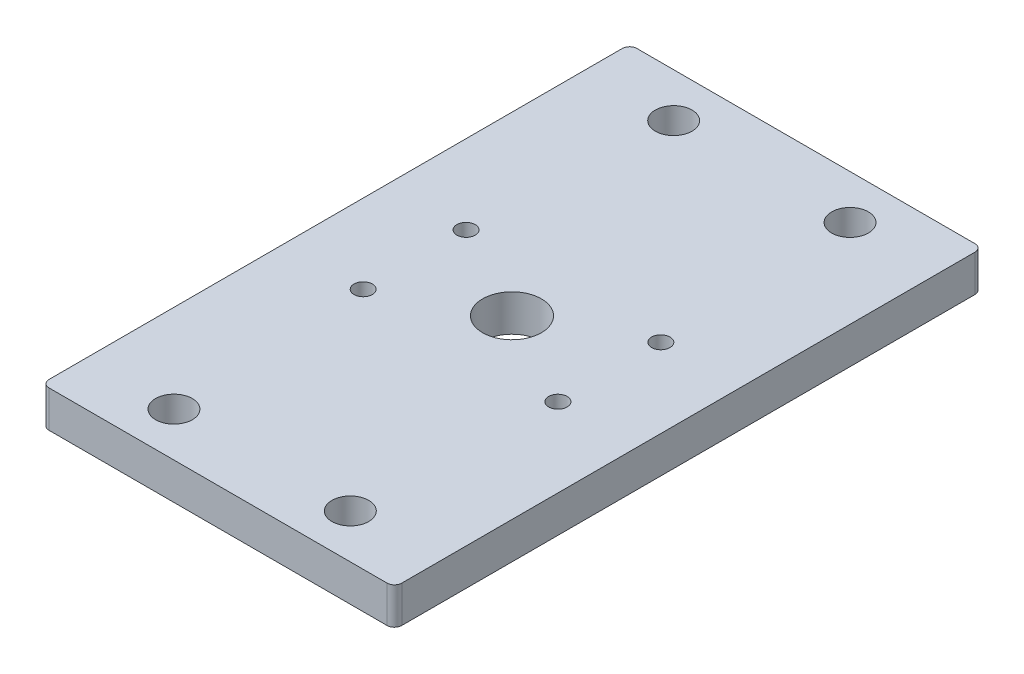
ISO-10303-21;
HEADER;
FILE_DESCRIPTION(('STEP AP214'),'2;1');
FILE_NAME('part.step','',(''),(''),'','','');
FILE_SCHEMA(('AUTOMOTIVE_DESIGN { 1 0 10303 214 1 1 1 1 }'));
ENDSEC;
DATA;
#1=APPLICATION_CONTEXT('core data for automotive mechanical design processes');
#2=APPLICATION_PROTOCOL_DEFINITION('international standard','automotive_design',2000,#1);
#3=PRODUCT_CONTEXT('',#1,'mechanical');
#4=PRODUCT('Part','Part','',(#3));
#5=PRODUCT_RELATED_PRODUCT_CATEGORY('part','',(#4));
#6=PRODUCT_DEFINITION_FORMATION('','',#4);
#7=PRODUCT_DEFINITION_CONTEXT('part definition',#1,'design');
#8=PRODUCT_DEFINITION('design','',#6,#7);
#9=PRODUCT_DEFINITION_SHAPE('','',#8);
#10=(LENGTH_UNIT() NAMED_UNIT(*) SI_UNIT(.MILLI.,.METRE.));
#11=(NAMED_UNIT(*) PLANE_ANGLE_UNIT() SI_UNIT($,.RADIAN.));
#12=(NAMED_UNIT(*) SI_UNIT($,.STERADIAN.) SOLID_ANGLE_UNIT());
#13=UNCERTAINTY_MEASURE_WITH_UNIT(LENGTH_MEASURE(1.E-05),#10,'distance_accuracy_value','');
#14=(GEOMETRIC_REPRESENTATION_CONTEXT(3) GLOBAL_UNCERTAINTY_ASSIGNED_CONTEXT((#13)) GLOBAL_UNIT_ASSIGNED_CONTEXT((#10,
#11,#12)) REPRESENTATION_CONTEXT('',''));
#15=CARTESIAN_POINT('',(0.,0.,0.));
#16=DIRECTION('',(0.,0.,1.));
#17=DIRECTION('',(1.,0.,0.));
#18=AXIS2_PLACEMENT_3D('',#15,#16,#17);
#19=CARTESIAN_POINT('',(152.4,31.75,0.));
#20=DIRECTION('',(1.,0.,0.));
#21=DIRECTION('',(0.,0.,-1.));
#22=AXIS2_PLACEMENT_3D('',#19,#20,#21);
#23=PLANE('',#22);
#24=DIRECTION('',(0.,0.,1.));
#25=VECTOR('',#24,1.);
#26=CARTESIAN_POINT('',(152.4,0.,0.));
#27=LINE('',#26,#25);
#28=CARTESIAN_POINT('',(152.4,0.,6.35000000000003));
#29=VERTEX_POINT('',#28);
#30=CARTESIAN_POINT('',(152.4,0.,501.65));
#31=VERTEX_POINT('',#30);
#32=EDGE_CURVE('E125',#29,#31,#27,.T.);
#33=ORIENTED_EDGE('',*,*,#32,.F.);
#34=DIRECTION('',(0.,-1.,0.));
#35=VECTOR('',#34,1.);
#36=CARTESIAN_POINT('',(152.4,31.75,6.35000000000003));
#37=LINE('',#36,#35);
#38=CARTESIAN_POINT('',(152.4,31.75,6.35000000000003));
#39=VERTEX_POINT('',#38);
#40=EDGE_CURVE('E11',#29,#39,#37,.F.);
#41=ORIENTED_EDGE('',*,*,#40,.T.);
#42=DIRECTION('',(0.,0.,1.));
#43=VECTOR('',#42,1.);
#44=CARTESIAN_POINT('',(152.4,31.75,0.));
#45=LINE('',#44,#43);
#46=CARTESIAN_POINT('',(152.4,31.75,501.65));
#47=VERTEX_POINT('',#46);
#48=EDGE_CURVE('E134',#39,#47,#45,.T.);
#49=ORIENTED_EDGE('',*,*,#48,.T.);
#50=DIRECTION('',(0.,-1.,0.));
#51=VECTOR('',#50,1.);
#52=CARTESIAN_POINT('',(152.4,0.,501.65));
#53=LINE('',#52,#51);
#54=EDGE_CURVE('E40',#47,#31,#53,.T.);
#55=ORIENTED_EDGE('',*,*,#54,.T.);
#56=EDGE_LOOP('',(#33,#41,#49,#55));
#57=FACE_BOUND('',#56,.T.);
#58=ADVANCED_FACE('F32',(#57),#23,.T.);
#59=CARTESIAN_POINT('',(152.4,31.75,0.));
#60=DIRECTION('',(0.,0.,1.));
#61=DIRECTION('',(1.,0.,0.));
#62=AXIS2_PLACEMENT_3D('',#59,#60,#61);
#63=PLANE('',#62);
#64=DIRECTION('',(-1.,0.,0.));
#65=VECTOR('',#64,1.);
#66=CARTESIAN_POINT('',(152.4,0.,0.));
#67=LINE('',#66,#65);
#68=CARTESIAN_POINT('',(146.05,0.,0.));
#69=VERTEX_POINT('',#68);
#70=CARTESIAN_POINT('',(-146.05,0.,0.));
#71=VERTEX_POINT('',#70);
#72=EDGE_CURVE('E127',#69,#71,#67,.T.);
#73=ORIENTED_EDGE('',*,*,#72,.T.);
#74=DIRECTION('',(0.,-1.,0.));
#75=VECTOR('',#74,1.);
#76=CARTESIAN_POINT('',(-146.05,31.75,0.));
#77=LINE('',#76,#75);
#78=CARTESIAN_POINT('',(-146.05,31.75,0.));
#79=VERTEX_POINT('',#78);
#80=EDGE_CURVE('E47',#71,#79,#77,.F.);
#81=ORIENTED_EDGE('',*,*,#80,.T.);
#82=DIRECTION('',(-1.,0.,0.));
#83=VECTOR('',#82,1.);
#84=CARTESIAN_POINT('',(152.4,31.75,0.));
#85=LINE('',#84,#83);
#86=CARTESIAN_POINT('',(146.05,31.75,0.));
#87=VERTEX_POINT('',#86);
#88=EDGE_CURVE('E135',#87,#79,#85,.T.);
#89=ORIENTED_EDGE('',*,*,#88,.F.);
#90=DIRECTION('',(0.,-1.,0.));
#91=VECTOR('',#90,1.);
#92=CARTESIAN_POINT('',(146.05,0.,0.));
#93=LINE('',#92,#91);
#94=EDGE_CURVE('E151',#87,#69,#93,.T.);
#95=ORIENTED_EDGE('',*,*,#94,.T.);
#96=EDGE_LOOP('',(#73,#81,#89,#95));
#97=FACE_BOUND('',#96,.T.);
#98=ADVANCED_FACE('F166',(#97),#63,.F.);
#99=CARTESIAN_POINT('',(-152.4,31.75,508.));
#100=DIRECTION('',(-1.,0.,0.));
#101=DIRECTION('',(0.,0.,1.));
#102=AXIS2_PLACEMENT_3D('',#99,#100,#101);
#103=PLANE('',#102);
#104=DIRECTION('',(0.,0.,-1.));
#105=VECTOR('',#104,1.);
#106=CARTESIAN_POINT('',(-152.4,0.,508.));
#107=LINE('',#106,#105);
#108=CARTESIAN_POINT('',(-152.4,0.,501.65));
#109=VERTEX_POINT('',#108);
#110=CARTESIAN_POINT('',(-152.4,0.,6.35000000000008));
#111=VERTEX_POINT('',#110);
#112=EDGE_CURVE('E124',#109,#111,#107,.T.);
#113=ORIENTED_EDGE('',*,*,#112,.F.);
#114=DIRECTION('',(0.,-1.,0.));
#115=VECTOR('',#114,1.);
#116=CARTESIAN_POINT('',(-152.4,31.75,501.65));
#117=LINE('',#116,#115);
#118=CARTESIAN_POINT('',(-152.4,31.75,501.65));
#119=VERTEX_POINT('',#118);
#120=EDGE_CURVE('E103',#109,#119,#117,.F.);
#121=ORIENTED_EDGE('',*,*,#120,.T.);
#122=DIRECTION('',(0.,0.,-1.));
#123=VECTOR('',#122,1.);
#124=CARTESIAN_POINT('',(-152.4,31.75,508.));
#125=LINE('',#124,#123);
#126=CARTESIAN_POINT('',(-152.4,31.75,6.35000000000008));
#127=VERTEX_POINT('',#126);
#128=EDGE_CURVE('E168',#119,#127,#125,.T.);
#129=ORIENTED_EDGE('',*,*,#128,.T.);
#130=DIRECTION('',(0.,-1.,0.));
#131=VECTOR('',#130,1.);
#132=CARTESIAN_POINT('',(-152.4,0.,6.35000000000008));
#133=LINE('',#132,#131);
#134=EDGE_CURVE('E108',#127,#111,#133,.T.);
#135=ORIENTED_EDGE('',*,*,#134,.T.);
#136=EDGE_LOOP('',(#113,#121,#129,#135));
#137=FACE_BOUND('',#136,.T.);
#138=ADVANCED_FACE('F269',(#137),#103,.T.);
#139=CARTESIAN_POINT('',(-152.4,31.75,508.));
#140=DIRECTION('',(0.,0.,-1.));
#141=DIRECTION('',(-1.,0.,0.));
#142=AXIS2_PLACEMENT_3D('',#139,#140,#141);
#143=PLANE('',#142);
#144=DIRECTION('',(1.,0.,0.));
#145=VECTOR('',#144,1.);
#146=CARTESIAN_POINT('',(-152.4,31.75,508.));
#147=LINE('',#146,#145);
#148=CARTESIAN_POINT('',(-146.05,31.75,508.));
#149=VERTEX_POINT('',#148);
#150=CARTESIAN_POINT('',(146.05,31.75,508.));
#151=VERTEX_POINT('',#150);
#152=EDGE_CURVE('E118',#149,#151,#147,.T.);
#153=ORIENTED_EDGE('',*,*,#152,.F.);
#154=DIRECTION('',(0.,-1.,0.));
#155=VECTOR('',#154,1.);
#156=CARTESIAN_POINT('',(-146.05,0.,508.));
#157=LINE('',#156,#155);
#158=CARTESIAN_POINT('',(-146.05,0.,508.));
#159=VERTEX_POINT('',#158);
#160=EDGE_CURVE('E102',#149,#159,#157,.T.);
#161=ORIENTED_EDGE('',*,*,#160,.T.);
#162=DIRECTION('',(1.,0.,0.));
#163=VECTOR('',#162,1.);
#164=CARTESIAN_POINT('',(-152.4,0.,508.));
#165=LINE('',#164,#163);
#166=CARTESIAN_POINT('',(146.05,0.,508.));
#167=VERTEX_POINT('',#166);
#168=EDGE_CURVE('E115',#159,#167,#165,.T.);
#169=ORIENTED_EDGE('',*,*,#168,.T.);
#170=DIRECTION('',(0.,-1.,0.));
#171=VECTOR('',#170,1.);
#172=CARTESIAN_POINT('',(146.05,31.75,508.));
#173=LINE('',#172,#171);
#174=EDGE_CURVE('E120',#167,#151,#173,.F.);
#175=ORIENTED_EDGE('',*,*,#174,.T.);
#176=EDGE_LOOP('',(#153,#161,#169,#175));
#177=FACE_BOUND('',#176,.T.);
#178=ADVANCED_FACE('F114',(#177),#143,.F.);
#179=CARTESIAN_POINT('',(152.4,31.75,0.));
#180=DIRECTION('',(0.,-1.,0.));
#181=DIRECTION('',(0.,0.,-1.));
#182=AXIS2_PLACEMENT_3D('',#179,#180,#181);
#183=PLANE('',#182);
#184=CARTESIAN_POINT('',(84.1375,31.75,209.55));
#185=DIRECTION('',(0.,-1.,0.));
#186=DIRECTION('',(0.,0.,-1.));
#187=AXIS2_PLACEMENT_3D('',#184,#185,#186);
#188=CIRCLE('',#187,7.93749999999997);
#189=CARTESIAN_POINT('',(84.1375,31.75,201.6125));
#190=VERTEX_POINT('',#189);
#191=EDGE_CURVE('E219',#190,#190,#188,.T.);
#192=ORIENTED_EDGE('',*,*,#191,.T.);
#193=EDGE_LOOP('',(#192));
#194=FACE_BOUND('',#193,.T.);
#195=CARTESIAN_POINT('',(84.1375,31.75,298.45));
#196=DIRECTION('',(0.,-1.,0.));
#197=DIRECTION('',(0.,0.,-1.));
#198=AXIS2_PLACEMENT_3D('',#195,#196,#197);
#199=CIRCLE('',#198,7.93749999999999);
#200=CARTESIAN_POINT('',(84.1375,31.75,290.5125));
#201=VERTEX_POINT('',#200);
#202=EDGE_CURVE('E213',#201,#201,#199,.T.);
#203=ORIENTED_EDGE('',*,*,#202,.T.);
#204=EDGE_LOOP('',(#203));
#205=FACE_BOUND('',#204,.T.);
#206=CARTESIAN_POINT('',(-84.1375,31.75,298.45));
#207=DIRECTION('',(0.,-1.,0.));
#208=DIRECTION('',(0.,0.,-1.));
#209=AXIS2_PLACEMENT_3D('',#206,#207,#208);
#210=CIRCLE('',#209,7.93749999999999);
#211=CARTESIAN_POINT('',(-84.1375,31.75,290.5125));
#212=VERTEX_POINT('',#211);
#213=EDGE_CURVE('E207',#212,#212,#210,.T.);
#214=ORIENTED_EDGE('',*,*,#213,.T.);
#215=EDGE_LOOP('',(#214));
#216=FACE_BOUND('',#215,.T.);
#217=CARTESIAN_POINT('',(-84.1375,31.75,209.55));
#218=DIRECTION('',(0.,-1.,0.));
#219=DIRECTION('',(0.,0.,-1.));
#220=AXIS2_PLACEMENT_3D('',#217,#218,#219);
#221=CIRCLE('',#220,7.93749999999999);
#222=CARTESIAN_POINT('',(-84.1375,31.75,201.6125));
#223=VERTEX_POINT('',#222);
#224=EDGE_CURVE('E201',#223,#223,#221,.T.);
#225=ORIENTED_EDGE('',*,*,#224,.T.);
#226=EDGE_LOOP('',(#225));
#227=FACE_BOUND('',#226,.T.);
#228=CARTESIAN_POINT('',(76.1999999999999,31.75,469.9));
#229=DIRECTION('',(0.,-1.,0.));
#230=DIRECTION('',(0.,0.,-1.));
#231=AXIS2_PLACEMENT_3D('',#228,#229,#230);
#232=CIRCLE('',#231,15.875);
#233=CARTESIAN_POINT('',(76.1999999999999,31.75,454.025));
#234=VERTEX_POINT('',#233);
#235=EDGE_CURVE('E195',#234,#234,#232,.T.);
#236=ORIENTED_EDGE('',*,*,#235,.T.);
#237=EDGE_LOOP('',(#236));
#238=FACE_BOUND('',#237,.T.);
#239=CARTESIAN_POINT('',(-76.2000000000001,31.75,469.9));
#240=DIRECTION('',(0.,-1.,0.));
#241=DIRECTION('',(0.,0.,-1.));
#242=AXIS2_PLACEMENT_3D('',#239,#240,#241);
#243=CIRCLE('',#242,15.875);
#244=CARTESIAN_POINT('',(-76.2000000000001,31.75,454.025));
#245=VERTEX_POINT('',#244);
#246=EDGE_CURVE('E189',#245,#245,#243,.T.);
#247=ORIENTED_EDGE('',*,*,#246,.T.);
#248=EDGE_LOOP('',(#247));
#249=FACE_BOUND('',#248,.T.);
#250=CARTESIAN_POINT('',(76.1999999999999,31.75,38.1));
#251=DIRECTION('',(0.,-1.,0.));
#252=DIRECTION('',(0.,0.,-1.));
#253=AXIS2_PLACEMENT_3D('',#250,#251,#252);
#254=CIRCLE('',#253,15.875);
#255=CARTESIAN_POINT('',(76.1999999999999,31.75,22.225));
#256=VERTEX_POINT('',#255);
#257=EDGE_CURVE('E183',#256,#256,#254,.T.);
#258=ORIENTED_EDGE('',*,*,#257,.T.);
#259=EDGE_LOOP('',(#258));
#260=FACE_BOUND('',#259,.T.);
#261=CARTESIAN_POINT('',(-76.2000000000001,31.75,38.1));
#262=DIRECTION('',(0.,-1.,0.));
#263=DIRECTION('',(0.,0.,-1.));
#264=AXIS2_PLACEMENT_3D('',#261,#262,#263);
#265=CIRCLE('',#264,15.875);
#266=CARTESIAN_POINT('',(-76.2000000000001,31.75,22.225));
#267=VERTEX_POINT('',#266);
#268=EDGE_CURVE('E177',#267,#267,#265,.T.);
#269=ORIENTED_EDGE('',*,*,#268,.T.);
#270=EDGE_LOOP('',(#269));
#271=FACE_BOUND('',#270,.T.);
#272=CARTESIAN_POINT('',(0.,31.75,254.));
#273=DIRECTION('',(0.,1.,0.));
#274=DIRECTION('',(0.,0.,1.));
#275=AXIS2_PLACEMENT_3D('',#272,#273,#274);
#276=CIRCLE('',#275,25.4);
#277=CARTESIAN_POINT('',(0.,31.75,279.4));
#278=VERTEX_POINT('',#277);
#279=EDGE_CURVE('E174',#278,#278,#276,.T.);
#280=ORIENTED_EDGE('',*,*,#279,.F.);
#281=EDGE_LOOP('',(#280));
#282=FACE_BOUND('',#281,.T.);
#283=ORIENTED_EDGE('',*,*,#128,.F.);
#284=CARTESIAN_POINT('',(-146.05,31.75,501.65));
#285=DIRECTION('',(0.,-1.,0.));
#286=DIRECTION('',(0.,0.,-1.));
#287=AXIS2_PLACEMENT_3D('',#284,#285,#286);
#288=CIRCLE('',#287,6.35);
#289=EDGE_CURVE('E149',#119,#149,#288,.F.);
#290=ORIENTED_EDGE('',*,*,#289,.T.);
#291=ORIENTED_EDGE('',*,*,#152,.T.);
#292=CARTESIAN_POINT('',(146.05,31.75,501.65));
#293=DIRECTION('',(0.,-1.,0.));
#294=DIRECTION('',(0.,0.,-1.));
#295=AXIS2_PLACEMENT_3D('',#292,#293,#294);
#296=CIRCLE('',#295,6.35);
#297=EDGE_CURVE('E144',#151,#47,#296,.F.);
#298=ORIENTED_EDGE('',*,*,#297,.T.);
#299=ORIENTED_EDGE('',*,*,#48,.F.);
#300=CARTESIAN_POINT('',(146.05,31.75,6.35000000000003));
#301=DIRECTION('',(0.,-1.,0.));
#302=DIRECTION('',(0.,0.,-1.));
#303=AXIS2_PLACEMENT_3D('',#300,#301,#302);
#304=CIRCLE('',#303,6.35);
#305=EDGE_CURVE('E54',#39,#87,#304,.F.);
#306=ORIENTED_EDGE('',*,*,#305,.T.);
#307=ORIENTED_EDGE('',*,*,#88,.T.);
#308=CARTESIAN_POINT('',(-146.05,31.75,6.35000000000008));
#309=DIRECTION('',(0.,-1.,0.));
#310=DIRECTION('',(0.,0.,-1.));
#311=AXIS2_PLACEMENT_3D('',#308,#309,#310);
#312=CIRCLE('',#311,6.35);
#313=EDGE_CURVE('E147',#79,#127,#312,.F.);
#314=ORIENTED_EDGE('',*,*,#313,.T.);
#315=EDGE_LOOP('',(#283,#290,#291,#298,#299,#306,#307,#314));
#316=FACE_BOUND('',#315,.T.);
#317=ADVANCED_FACE('F228',(#194,#205,#216,#227,#238,#249,#260,#271,#282,#316),#183,.F.);
#318=CARTESIAN_POINT('',(152.4,0.,0.));
#319=DIRECTION('',(0.,-1.,0.));
#320=DIRECTION('',(0.,0.,-1.));
#321=AXIS2_PLACEMENT_3D('',#318,#319,#320);
#322=PLANE('',#321);
#323=CARTESIAN_POINT('',(84.1375,0.,209.55));
#324=DIRECTION('',(0.,-1.,0.));
#325=DIRECTION('',(0.,0.,-1.));
#326=AXIS2_PLACEMENT_3D('',#323,#324,#325);
#327=CIRCLE('',#326,7.93749999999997);
#328=CARTESIAN_POINT('',(84.1375,0.,201.6125));
#329=VERTEX_POINT('',#328);
#330=EDGE_CURVE('E222',#329,#329,#327,.T.);
#331=ORIENTED_EDGE('',*,*,#330,.F.);
#332=EDGE_LOOP('',(#331));
#333=FACE_BOUND('',#332,.T.);
#334=CARTESIAN_POINT('',(84.1375,0.,298.45));
#335=DIRECTION('',(0.,-1.,0.));
#336=DIRECTION('',(0.,0.,-1.));
#337=AXIS2_PLACEMENT_3D('',#334,#335,#336);
#338=CIRCLE('',#337,7.93749999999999);
#339=CARTESIAN_POINT('',(84.1375,0.,290.5125));
#340=VERTEX_POINT('',#339);
#341=EDGE_CURVE('E216',#340,#340,#338,.T.);
#342=ORIENTED_EDGE('',*,*,#341,.F.);
#343=EDGE_LOOP('',(#342));
#344=FACE_BOUND('',#343,.T.);
#345=CARTESIAN_POINT('',(-84.1375,0.,298.45));
#346=DIRECTION('',(0.,-1.,0.));
#347=DIRECTION('',(0.,0.,-1.));
#348=AXIS2_PLACEMENT_3D('',#345,#346,#347);
#349=CIRCLE('',#348,7.93749999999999);
#350=CARTESIAN_POINT('',(-84.1375,0.,290.5125));
#351=VERTEX_POINT('',#350);
#352=EDGE_CURVE('E210',#351,#351,#349,.T.);
#353=ORIENTED_EDGE('',*,*,#352,.F.);
#354=EDGE_LOOP('',(#353));
#355=FACE_BOUND('',#354,.T.);
#356=CARTESIAN_POINT('',(-84.1375,0.,209.55));
#357=DIRECTION('',(0.,-1.,0.));
#358=DIRECTION('',(0.,0.,-1.));
#359=AXIS2_PLACEMENT_3D('',#356,#357,#358);
#360=CIRCLE('',#359,7.93749999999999);
#361=CARTESIAN_POINT('',(-84.1375,0.,201.6125));
#362=VERTEX_POINT('',#361);
#363=EDGE_CURVE('E204',#362,#362,#360,.T.);
#364=ORIENTED_EDGE('',*,*,#363,.F.);
#365=EDGE_LOOP('',(#364));
#366=FACE_BOUND('',#365,.T.);
#367=CARTESIAN_POINT('',(76.1999999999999,0.,469.9));
#368=DIRECTION('',(0.,-1.,0.));
#369=DIRECTION('',(0.,0.,-1.));
#370=AXIS2_PLACEMENT_3D('',#367,#368,#369);
#371=CIRCLE('',#370,15.875);
#372=CARTESIAN_POINT('',(76.1999999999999,0.,454.025));
#373=VERTEX_POINT('',#372);
#374=EDGE_CURVE('E198',#373,#373,#371,.T.);
#375=ORIENTED_EDGE('',*,*,#374,.F.);
#376=EDGE_LOOP('',(#375));
#377=FACE_BOUND('',#376,.T.);
#378=CARTESIAN_POINT('',(-76.2000000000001,0.,469.9));
#379=DIRECTION('',(0.,-1.,0.));
#380=DIRECTION('',(0.,0.,-1.));
#381=AXIS2_PLACEMENT_3D('',#378,#379,#380);
#382=CIRCLE('',#381,15.875);
#383=CARTESIAN_POINT('',(-76.2000000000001,0.,454.025));
#384=VERTEX_POINT('',#383);
#385=EDGE_CURVE('E192',#384,#384,#382,.T.);
#386=ORIENTED_EDGE('',*,*,#385,.F.);
#387=EDGE_LOOP('',(#386));
#388=FACE_BOUND('',#387,.T.);
#389=CARTESIAN_POINT('',(76.1999999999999,0.,38.1));
#390=DIRECTION('',(0.,-1.,0.));
#391=DIRECTION('',(0.,0.,-1.));
#392=AXIS2_PLACEMENT_3D('',#389,#390,#391);
#393=CIRCLE('',#392,15.875);
#394=CARTESIAN_POINT('',(76.1999999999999,0.,22.225));
#395=VERTEX_POINT('',#394);
#396=EDGE_CURVE('E186',#395,#395,#393,.T.);
#397=ORIENTED_EDGE('',*,*,#396,.F.);
#398=EDGE_LOOP('',(#397));
#399=FACE_BOUND('',#398,.T.);
#400=CARTESIAN_POINT('',(-76.2000000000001,0.,38.1));
#401=DIRECTION('',(0.,-1.,0.));
#402=DIRECTION('',(0.,0.,-1.));
#403=AXIS2_PLACEMENT_3D('',#400,#401,#402);
#404=CIRCLE('',#403,15.875);
#405=CARTESIAN_POINT('',(-76.2000000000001,0.,22.225));
#406=VERTEX_POINT('',#405);
#407=EDGE_CURVE('E180',#406,#406,#404,.T.);
#408=ORIENTED_EDGE('',*,*,#407,.F.);
#409=EDGE_LOOP('',(#408));
#410=FACE_BOUND('',#409,.T.);
#411=CARTESIAN_POINT('',(0.,0.,254.));
#412=DIRECTION('',(0.,1.,0.));
#413=DIRECTION('',(0.,0.,1.));
#414=AXIS2_PLACEMENT_3D('',#411,#412,#413);
#415=CIRCLE('',#414,25.4);
#416=CARTESIAN_POINT('',(0.,0.,279.4));
#417=VERTEX_POINT('',#416);
#418=EDGE_CURVE('E129',#417,#417,#415,.T.);
#419=ORIENTED_EDGE('',*,*,#418,.T.);
#420=EDGE_LOOP('',(#419));
#421=FACE_BOUND('',#420,.T.);
#422=ORIENTED_EDGE('',*,*,#168,.F.);
#423=CARTESIAN_POINT('',(-146.05,0.,501.65));
#424=DIRECTION('',(0.,-1.,0.));
#425=DIRECTION('',(0.,0.,-1.));
#426=AXIS2_PLACEMENT_3D('',#423,#424,#425);
#427=CIRCLE('',#426,6.35);
#428=EDGE_CURVE('E98',#159,#109,#427,.T.);
#429=ORIENTED_EDGE('',*,*,#428,.T.);
#430=ORIENTED_EDGE('',*,*,#112,.T.);
#431=CARTESIAN_POINT('',(-146.05,0.,6.35000000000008));
#432=DIRECTION('',(0.,-1.,0.));
#433=DIRECTION('',(0.,0.,-1.));
#434=AXIS2_PLACEMENT_3D('',#431,#432,#433);
#435=CIRCLE('',#434,6.35);
#436=EDGE_CURVE('E109',#111,#71,#435,.T.);
#437=ORIENTED_EDGE('',*,*,#436,.T.);
#438=ORIENTED_EDGE('',*,*,#72,.F.);
#439=CARTESIAN_POINT('',(146.05,0.,6.35000000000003));
#440=DIRECTION('',(0.,-1.,0.));
#441=DIRECTION('',(0.,0.,-1.));
#442=AXIS2_PLACEMENT_3D('',#439,#440,#441);
#443=CIRCLE('',#442,6.35);
#444=EDGE_CURVE('E138',#69,#29,#443,.T.);
#445=ORIENTED_EDGE('',*,*,#444,.T.);
#446=ORIENTED_EDGE('',*,*,#32,.T.);
#447=CARTESIAN_POINT('',(146.05,0.,501.65));
#448=DIRECTION('',(0.,-1.,0.));
#449=DIRECTION('',(0.,0.,-1.));
#450=AXIS2_PLACEMENT_3D('',#447,#448,#449);
#451=CIRCLE('',#450,6.35);
#452=EDGE_CURVE('E119',#31,#167,#451,.T.);
#453=ORIENTED_EDGE('',*,*,#452,.T.);
#454=EDGE_LOOP('',(#422,#429,#430,#437,#438,#445,#446,#453));
#455=FACE_BOUND('',#454,.T.);
#456=ADVANCED_FACE('F122',(#333,#344,#355,#366,#377,#388,#399,#410,#421,#455),#322,.T.);
#457=CARTESIAN_POINT('',(0.,0.,254.));
#458=DIRECTION('',(0.,1.,0.));
#459=DIRECTION('',(0.,0.,1.));
#460=AXIS2_PLACEMENT_3D('',#457,#458,#459);
#461=CYLINDRICAL_SURFACE('',#460,25.4);
#462=ORIENTED_EDGE('',*,*,#418,.F.);
#463=EDGE_LOOP('',(#462));
#464=FACE_BOUND('',#463,.T.);
#465=ORIENTED_EDGE('',*,*,#279,.T.);
#466=EDGE_LOOP('',(#465));
#467=FACE_BOUND('',#466,.T.);
#468=ADVANCED_FACE('F240',(#464,#467),#461,.F.);
#469=CARTESIAN_POINT('',(-76.2000000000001,31.75,38.1));
#470=DIRECTION('',(0.,-1.,0.));
#471=DIRECTION('',(0.,0.,-1.));
#472=AXIS2_PLACEMENT_3D('',#469,#470,#471);
#473=CYLINDRICAL_SURFACE('',#472,15.875);
#474=ORIENTED_EDGE('',*,*,#268,.F.);
#475=EDGE_LOOP('',(#474));
#476=FACE_BOUND('',#475,.T.);
#477=ORIENTED_EDGE('',*,*,#407,.T.);
#478=EDGE_LOOP('',(#477));
#479=FACE_BOUND('',#478,.T.);
#480=ADVANCED_FACE('F260',(#476,#479),#473,.F.);
#481=CARTESIAN_POINT('',(76.1999999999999,31.75,38.1));
#482=DIRECTION('',(0.,-1.,0.));
#483=DIRECTION('',(0.,0.,-1.));
#484=AXIS2_PLACEMENT_3D('',#481,#482,#483);
#485=CYLINDRICAL_SURFACE('',#484,15.875);
#486=ORIENTED_EDGE('',*,*,#257,.F.);
#487=EDGE_LOOP('',(#486));
#488=FACE_BOUND('',#487,.T.);
#489=ORIENTED_EDGE('',*,*,#396,.T.);
#490=EDGE_LOOP('',(#489));
#491=FACE_BOUND('',#490,.T.);
#492=ADVANCED_FACE('F292',(#488,#491),#485,.F.);
#493=CARTESIAN_POINT('',(-76.2000000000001,31.75,469.9));
#494=DIRECTION('',(0.,-1.,0.));
#495=DIRECTION('',(0.,0.,-1.));
#496=AXIS2_PLACEMENT_3D('',#493,#494,#495);
#497=CYLINDRICAL_SURFACE('',#496,15.875);
#498=ORIENTED_EDGE('',*,*,#246,.F.);
#499=EDGE_LOOP('',(#498));
#500=FACE_BOUND('',#499,.T.);
#501=ORIENTED_EDGE('',*,*,#385,.T.);
#502=EDGE_LOOP('',(#501));
#503=FACE_BOUND('',#502,.T.);
#504=ADVANCED_FACE('F296',(#500,#503),#497,.F.);
#505=CARTESIAN_POINT('',(76.1999999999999,31.75,469.9));
#506=DIRECTION('',(0.,-1.,0.));
#507=DIRECTION('',(0.,0.,-1.));
#508=AXIS2_PLACEMENT_3D('',#505,#506,#507);
#509=CYLINDRICAL_SURFACE('',#508,15.875);
#510=ORIENTED_EDGE('',*,*,#235,.F.);
#511=EDGE_LOOP('',(#510));
#512=FACE_BOUND('',#511,.T.);
#513=ORIENTED_EDGE('',*,*,#374,.T.);
#514=EDGE_LOOP('',(#513));
#515=FACE_BOUND('',#514,.T.);
#516=ADVANCED_FACE('F300',(#512,#515),#509,.F.);
#517=CARTESIAN_POINT('',(-84.1375,31.75,209.55));
#518=DIRECTION('',(0.,-1.,0.));
#519=DIRECTION('',(0.,0.,-1.));
#520=AXIS2_PLACEMENT_3D('',#517,#518,#519);
#521=CYLINDRICAL_SURFACE('',#520,7.93749999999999);
#522=ORIENTED_EDGE('',*,*,#224,.F.);
#523=EDGE_LOOP('',(#522));
#524=FACE_BOUND('',#523,.T.);
#525=ORIENTED_EDGE('',*,*,#363,.T.);
#526=EDGE_LOOP('',(#525));
#527=FACE_BOUND('',#526,.T.);
#528=ADVANCED_FACE('F304',(#524,#527),#521,.F.);
#529=CARTESIAN_POINT('',(-84.1375,31.75,298.45));
#530=DIRECTION('',(0.,-1.,0.));
#531=DIRECTION('',(0.,0.,-1.));
#532=AXIS2_PLACEMENT_3D('',#529,#530,#531);
#533=CYLINDRICAL_SURFACE('',#532,7.93749999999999);
#534=ORIENTED_EDGE('',*,*,#213,.F.);
#535=EDGE_LOOP('',(#534));
#536=FACE_BOUND('',#535,.T.);
#537=ORIENTED_EDGE('',*,*,#352,.T.);
#538=EDGE_LOOP('',(#537));
#539=FACE_BOUND('',#538,.T.);
#540=ADVANCED_FACE('F308',(#536,#539),#533,.F.);
#541=CARTESIAN_POINT('',(84.1375,31.75,298.45));
#542=DIRECTION('',(0.,-1.,0.));
#543=DIRECTION('',(0.,0.,-1.));
#544=AXIS2_PLACEMENT_3D('',#541,#542,#543);
#545=CYLINDRICAL_SURFACE('',#544,7.93749999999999);
#546=ORIENTED_EDGE('',*,*,#202,.F.);
#547=EDGE_LOOP('',(#546));
#548=FACE_BOUND('',#547,.T.);
#549=ORIENTED_EDGE('',*,*,#341,.T.);
#550=EDGE_LOOP('',(#549));
#551=FACE_BOUND('',#550,.T.);
#552=ADVANCED_FACE('F234',(#548,#551),#545,.F.);
#553=CARTESIAN_POINT('',(84.1375,31.75,209.55));
#554=DIRECTION('',(0.,-1.,0.));
#555=DIRECTION('',(0.,0.,-1.));
#556=AXIS2_PLACEMENT_3D('',#553,#554,#555);
#557=CYLINDRICAL_SURFACE('',#556,7.93749999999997);
#558=ORIENTED_EDGE('',*,*,#191,.F.);
#559=EDGE_LOOP('',(#558));
#560=FACE_BOUND('',#559,.T.);
#561=ORIENTED_EDGE('',*,*,#330,.T.);
#562=EDGE_LOOP('',(#561));
#563=FACE_BOUND('',#562,.T.);
#564=ADVANCED_FACE('F231',(#560,#563),#557,.F.);
#565=CARTESIAN_POINT('',(-146.05,31.75,501.65));
#566=DIRECTION('',(0.,1.,0.));
#567=DIRECTION('',(0.,0.,1.));
#568=AXIS2_PLACEMENT_3D('',#565,#566,#567);
#569=CYLINDRICAL_SURFACE('',#568,6.35);
#570=ORIENTED_EDGE('',*,*,#289,.F.);
#571=ORIENTED_EDGE('',*,*,#120,.F.);
#572=ORIENTED_EDGE('',*,*,#428,.F.);
#573=ORIENTED_EDGE('',*,*,#160,.F.);
#574=EDGE_LOOP('',(#570,#571,#572,#573));
#575=FACE_BOUND('',#574,.T.);
#576=ADVANCED_FACE('F101',(#575),#569,.T.);
#577=CARTESIAN_POINT('',(-146.05,31.75,6.35000000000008));
#578=DIRECTION('',(0.,1.,0.));
#579=DIRECTION('',(0.,0.,1.));
#580=AXIS2_PLACEMENT_3D('',#577,#578,#579);
#581=CYLINDRICAL_SURFACE('',#580,6.35);
#582=ORIENTED_EDGE('',*,*,#313,.F.);
#583=ORIENTED_EDGE('',*,*,#80,.F.);
#584=ORIENTED_EDGE('',*,*,#436,.F.);
#585=ORIENTED_EDGE('',*,*,#134,.F.);
#586=EDGE_LOOP('',(#582,#583,#584,#585));
#587=FACE_BOUND('',#586,.T.);
#588=ADVANCED_FACE('F271',(#587),#581,.T.);
#589=CARTESIAN_POINT('',(146.05,31.75,6.35000000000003));
#590=DIRECTION('',(0.,1.,0.));
#591=DIRECTION('',(0.,0.,1.));
#592=AXIS2_PLACEMENT_3D('',#589,#590,#591);
#593=CYLINDRICAL_SURFACE('',#592,6.35);
#594=ORIENTED_EDGE('',*,*,#305,.F.);
#595=ORIENTED_EDGE('',*,*,#40,.F.);
#596=ORIENTED_EDGE('',*,*,#444,.F.);
#597=ORIENTED_EDGE('',*,*,#94,.F.);
#598=EDGE_LOOP('',(#594,#595,#596,#597));
#599=FACE_BOUND('',#598,.T.);
#600=ADVANCED_FACE('F165',(#599),#593,.T.);
#601=CARTESIAN_POINT('',(146.05,31.75,501.65));
#602=DIRECTION('',(0.,1.,0.));
#603=DIRECTION('',(0.,0.,1.));
#604=AXIS2_PLACEMENT_3D('',#601,#602,#603);
#605=CYLINDRICAL_SURFACE('',#604,6.35);
#606=ORIENTED_EDGE('',*,*,#297,.F.);
#607=ORIENTED_EDGE('',*,*,#174,.F.);
#608=ORIENTED_EDGE('',*,*,#452,.F.);
#609=ORIENTED_EDGE('',*,*,#54,.F.);
#610=EDGE_LOOP('',(#606,#607,#608,#609));
#611=FACE_BOUND('',#610,.T.);
#612=ADVANCED_FACE('F34',(#611),#605,.T.);
#613=CLOSED_SHELL('',(#58,#98,#138,#178,#317,#456,#468,#480,#492,#504,#516,#528,#540,#552,#564,
#576,#588,#600,#612));
#614=MANIFOLD_SOLID_BREP('B2',#613);
#615=ADVANCED_BREP_SHAPE_REPRESENTATION('',(#18,#614),#14);
#616=SHAPE_DEFINITION_REPRESENTATION(#9,#615);
ENDSEC;
END-ISO-10303-21;
